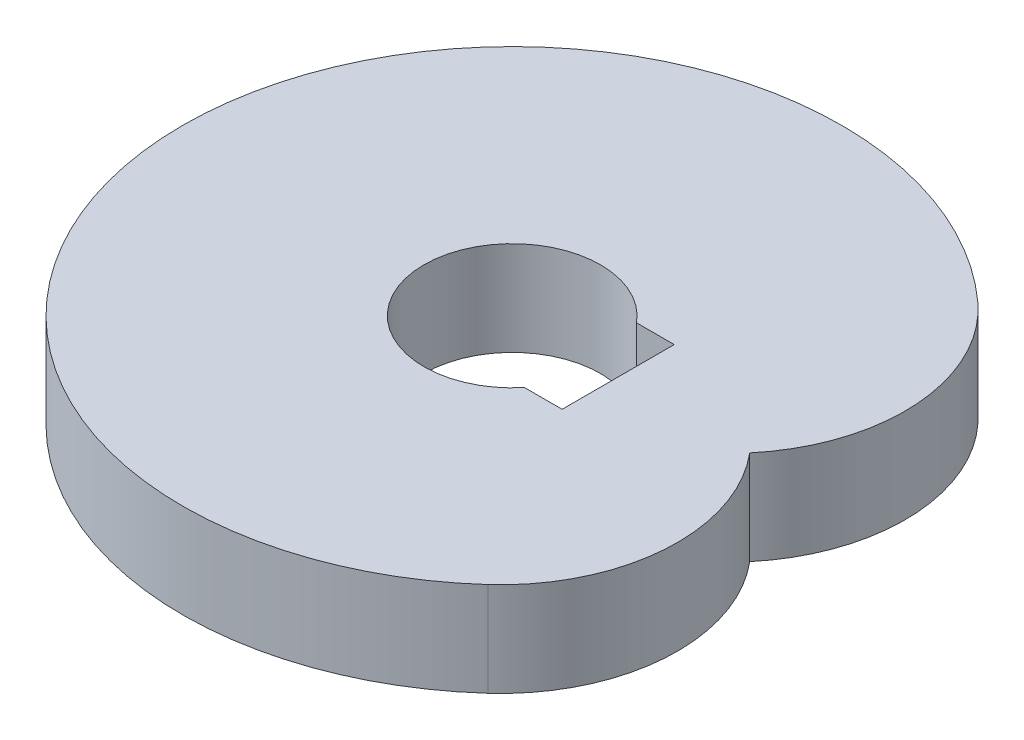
ISO-10303-21;
HEADER;
FILE_DESCRIPTION(('STEP AP214'),'2;1');
FILE_NAME('part.step','',(''),(''),'','','');
FILE_SCHEMA(('AUTOMOTIVE_DESIGN { 1 0 10303 214 1 1 1 1 }'));
ENDSEC;
DATA;
#1=APPLICATION_CONTEXT('core data for automotive mechanical design processes');
#2=APPLICATION_PROTOCOL_DEFINITION('international standard','automotive_design',2000,#1);
#3=PRODUCT_CONTEXT('',#1,'mechanical');
#4=PRODUCT('Part','Part','',(#3));
#5=PRODUCT_RELATED_PRODUCT_CATEGORY('part','',(#4));
#6=PRODUCT_DEFINITION_FORMATION('','',#4);
#7=PRODUCT_DEFINITION_CONTEXT('part definition',#1,'design');
#8=PRODUCT_DEFINITION('design','',#6,#7);
#9=PRODUCT_DEFINITION_SHAPE('','',#8);
#10=(LENGTH_UNIT() NAMED_UNIT(*) SI_UNIT(.MILLI.,.METRE.));
#11=(NAMED_UNIT(*) PLANE_ANGLE_UNIT() SI_UNIT($,.RADIAN.));
#12=(NAMED_UNIT(*) SI_UNIT($,.STERADIAN.) SOLID_ANGLE_UNIT());
#13=UNCERTAINTY_MEASURE_WITH_UNIT(LENGTH_MEASURE(1.E-05),#10,'distance_accuracy_value','');
#14=(GEOMETRIC_REPRESENTATION_CONTEXT(3) GLOBAL_UNCERTAINTY_ASSIGNED_CONTEXT((#13)) GLOBAL_UNIT_ASSIGNED_CONTEXT((#10,
#11,#12)) REPRESENTATION_CONTEXT('',''));
#15=CARTESIAN_POINT('',(0.,0.,0.));
#16=DIRECTION('',(0.,0.,1.));
#17=DIRECTION('',(1.,0.,0.));
#18=AXIS2_PLACEMENT_3D('',#15,#16,#17);
#19=CARTESIAN_POINT('',(-12.9999999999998,0.,119.));
#20=DIRECTION('',(0.,0.,1.));
#21=DIRECTION('',(1.,0.,0.));
#22=AXIS2_PLACEMENT_3D('',#19,#20,#21);
#23=PLANE('',#22);
#24=DIRECTION('',(0.,1.,0.));
#25=VECTOR('',#24,1.);
#26=CARTESIAN_POINT('',(144.897377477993,200.,119.));
#27=LINE('',#26,#25);
#28=CARTESIAN_POINT('',(144.897377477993,0.,119.));
#29=VERTEX_POINT('',#28);
#30=CARTESIAN_POINT('',(144.897377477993,200.,119.));
#31=VERTEX_POINT('',#30);
#32=EDGE_CURVE('E127',#29,#31,#27,.T.);
#33=ORIENTED_EDGE('',*,*,#32,.T.);
#34=DIRECTION('',(1.,0.,0.));
#35=VECTOR('',#34,1.);
#36=CARTESIAN_POINT('',(-12.9999999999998,200.,119.));
#37=LINE('',#36,#35);
#38=CARTESIAN_POINT('',(225.,200.,119.));
#39=VERTEX_POINT('',#38);
#40=EDGE_CURVE('E147',#31,#39,#37,.T.);
#41=ORIENTED_EDGE('',*,*,#40,.T.);
#42=DIRECTION('',(0.,1.,0.));
#43=VECTOR('',#42,1.);
#44=CARTESIAN_POINT('',(225.,0.,119.));
#45=LINE('',#44,#43);
#46=CARTESIAN_POINT('',(225.,0.,119.));
#47=VERTEX_POINT('',#46);
#48=EDGE_CURVE('E11',#47,#39,#45,.T.);
#49=ORIENTED_EDGE('',*,*,#48,.F.);
#50=DIRECTION('',(1.,0.,0.));
#51=VECTOR('',#50,1.);
#52=CARTESIAN_POINT('',(0.,0.,119.));
#53=LINE('',#52,#51);
#54=EDGE_CURVE('E150',#29,#47,#53,.T.);
#55=ORIENTED_EDGE('',*,*,#54,.F.);
#56=EDGE_LOOP('',(#33,#41,#49,#55));
#57=FACE_BOUND('',#56,.T.);
#58=ADVANCED_FACE('F16',(#57),#23,.F.);
#59=CARTESIAN_POINT('',(225.,0.,-119.));
#60=DIRECTION('',(1.,0.,0.));
#61=DIRECTION('',(0.,1.,0.));
#62=AXIS2_PLACEMENT_3D('',#59,#60,#61);
#63=PLANE('',#62);
#64=DIRECTION('',(0.,0.,-1.));
#65=VECTOR('',#64,1.);
#66=CARTESIAN_POINT('',(225.,200.,-119.));
#67=LINE('',#66,#65);
#68=CARTESIAN_POINT('',(225.,200.,-119.));
#69=VERTEX_POINT('',#68);
#70=EDGE_CURVE('E137',#39,#69,#67,.T.);
#71=ORIENTED_EDGE('',*,*,#70,.T.);
#72=DIRECTION('',(0.,1.,0.));
#73=VECTOR('',#72,1.);
#74=CARTESIAN_POINT('',(225.,0.,-119.));
#75=LINE('',#74,#73);
#76=CARTESIAN_POINT('',(225.,0.,-119.));
#77=VERTEX_POINT('',#76);
#78=EDGE_CURVE('E27',#77,#69,#75,.T.);
#79=ORIENTED_EDGE('',*,*,#78,.F.);
#80=DIRECTION('',(0.,0.,-1.));
#81=VECTOR('',#80,1.);
#82=CARTESIAN_POINT('',(225.,0.,-119.));
#83=LINE('',#82,#81);
#84=EDGE_CURVE('E142',#47,#77,#83,.T.);
#85=ORIENTED_EDGE('',*,*,#84,.F.);
#86=ORIENTED_EDGE('',*,*,#48,.T.);
#87=EDGE_LOOP('',(#71,#79,#85,#86));
#88=FACE_BOUND('',#87,.T.);
#89=ADVANCED_FACE('F164',(#88),#63,.F.);
#90=CARTESIAN_POINT('',(-12.9999999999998,0.,-119.));
#91=DIRECTION('',(0.,0.,-1.));
#92=DIRECTION('',(0.,-1.,0.));
#93=AXIS2_PLACEMENT_3D('',#90,#91,#92);
#94=PLANE('',#93);
#95=DIRECTION('',(0.,-1.,0.));
#96=VECTOR('',#95,1.);
#97=CARTESIAN_POINT('',(144.897377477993,200.,-119.));
#98=LINE('',#97,#96);
#99=CARTESIAN_POINT('',(144.897377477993,200.,-119.));
#100=VERTEX_POINT('',#99);
#101=CARTESIAN_POINT('',(144.897377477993,0.,-119.));
#102=VERTEX_POINT('',#101);
#103=EDGE_CURVE('E141',#100,#102,#98,.T.);
#104=ORIENTED_EDGE('',*,*,#103,.T.);
#105=DIRECTION('',(-1.,0.,0.));
#106=VECTOR('',#105,1.);
#107=CARTESIAN_POINT('',(-12.9999999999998,0.,-119.));
#108=LINE('',#107,#106);
#109=EDGE_CURVE('E146',#77,#102,#108,.T.);
#110=ORIENTED_EDGE('',*,*,#109,.F.);
#111=ORIENTED_EDGE('',*,*,#78,.T.);
#112=DIRECTION('',(-1.,0.,0.));
#113=VECTOR('',#112,1.);
#114=CARTESIAN_POINT('',(-12.9999999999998,200.,-119.));
#115=LINE('',#114,#113);
#116=EDGE_CURVE('E133',#69,#100,#115,.T.);
#117=ORIENTED_EDGE('',*,*,#116,.T.);
#118=EDGE_LOOP('',(#104,#110,#111,#117));
#119=FACE_BOUND('',#118,.T.);
#120=ADVANCED_FACE('F173',(#119),#94,.F.);
#121=CARTESIAN_POINT('',(0.,0.,0.));
#122=DIRECTION('',(0.,1.,0.));
#123=DIRECTION('',(1.,0.,0.));
#124=AXIS2_PLACEMENT_3D('',#121,#122,#123);
#125=PLANE('',#124);
#126=ORIENTED_EDGE('',*,*,#84,.T.);
#127=ORIENTED_EDGE('',*,*,#109,.T.);
#128=CARTESIAN_POINT('',(0.,0.,0.));
#129=DIRECTION('',(0.,1.,0.));
#130=DIRECTION('',(0.,0.,1.));
#131=AXIS2_PLACEMENT_3D('',#128,#129,#130);
#132=CIRCLE('',#131,187.5);
#133=EDGE_CURVE('E130',#102,#29,#132,.T.);
#134=ORIENTED_EDGE('',*,*,#133,.T.);
#135=ORIENTED_EDGE('',*,*,#54,.T.);
#136=EDGE_LOOP('',(#126,#127,#134,#135));
#137=FACE_BOUND('',#136,.T.);
#138=CARTESIAN_POINT('',(217.46744706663,0.,241.522068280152));
#139=DIRECTION('',(0.,1.,0.));
#140=DIRECTION('',(0.,0.,1.));
#141=AXIS2_PLACEMENT_3D('',#138,#139,#140);
#142=CIRCLE('',#141,375.);
#143=CARTESIAN_POINT('',(468.391424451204,0.,520.201377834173));
#144=VERTEX_POINT('',#143);
#145=CARTESIAN_POINT('',(504.333427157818,0.,-1.38777878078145E-13));
#146=VERTEX_POINT('',#145);
#147=EDGE_CURVE('E96',#144,#146,#142,.T.);
#148=ORIENTED_EDGE('',*,*,#147,.F.);
#149=CARTESIAN_POINT('',(0.,0.,0.));
#150=DIRECTION('',(0.,1.,0.));
#151=DIRECTION('',(0.,0.,1.));
#152=AXIS2_PLACEMENT_3D('',#149,#150,#151);
#153=CIRCLE('',#152,700.);
#154=CARTESIAN_POINT('',(468.391424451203,0.,-520.201377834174));
#155=VERTEX_POINT('',#154);
#156=EDGE_CURVE('E97',#155,#144,#153,.T.);
#157=ORIENTED_EDGE('',*,*,#156,.F.);
#158=CARTESIAN_POINT('',(217.46744706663,0.,-241.522068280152));
#159=DIRECTION('',(0.,1.,0.));
#160=DIRECTION('',(0.,0.,1.));
#161=AXIS2_PLACEMENT_3D('',#158,#159,#160);
#162=CIRCLE('',#161,375.);
#163=EDGE_CURVE('E93',#146,#155,#162,.T.);
#164=ORIENTED_EDGE('',*,*,#163,.F.);
#165=EDGE_LOOP('',(#148,#157,#164));
#166=FACE_BOUND('',#165,.T.);
#167=ADVANCED_FACE('F18',(#137,#166),#125,.F.);
#168=CARTESIAN_POINT('',(0.,200.,0.));
#169=DIRECTION('',(0.,1.,0.));
#170=DIRECTION('',(1.,0.,0.));
#171=AXIS2_PLACEMENT_3D('',#168,#169,#170);
#172=PLANE('',#171);
#173=ORIENTED_EDGE('',*,*,#116,.F.);
#174=ORIENTED_EDGE('',*,*,#70,.F.);
#175=ORIENTED_EDGE('',*,*,#40,.F.);
#176=CARTESIAN_POINT('',(0.,200.,0.));
#177=DIRECTION('',(0.,1.,0.));
#178=DIRECTION('',(0.,0.,1.));
#179=AXIS2_PLACEMENT_3D('',#176,#177,#178);
#180=CIRCLE('',#179,187.5);
#181=EDGE_CURVE('E125',#100,#31,#180,.T.);
#182=ORIENTED_EDGE('',*,*,#181,.F.);
#183=EDGE_LOOP('',(#173,#174,#175,#182));
#184=FACE_BOUND('',#183,.T.);
#185=CARTESIAN_POINT('',(217.46744706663,200.,241.522068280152));
#186=DIRECTION('',(0.,1.,0.));
#187=DIRECTION('',(0.,0.,1.));
#188=AXIS2_PLACEMENT_3D('',#185,#186,#187);
#189=CIRCLE('',#188,375.);
#190=CARTESIAN_POINT('',(468.391424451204,200.,520.201377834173));
#191=VERTEX_POINT('',#190);
#192=CARTESIAN_POINT('',(504.333427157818,200.,-1.38777878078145E-13));
#193=VERTEX_POINT('',#192);
#194=EDGE_CURVE('E113',#191,#193,#189,.T.);
#195=ORIENTED_EDGE('',*,*,#194,.T.);
#196=CARTESIAN_POINT('',(217.46744706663,200.,-241.522068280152));
#197=DIRECTION('',(0.,1.,0.));
#198=DIRECTION('',(0.,0.,1.));
#199=AXIS2_PLACEMENT_3D('',#196,#197,#198);
#200=CIRCLE('',#199,375.);
#201=CARTESIAN_POINT('',(468.391424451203,200.,-520.201377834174));
#202=VERTEX_POINT('',#201);
#203=EDGE_CURVE('E20',#193,#202,#200,.T.);
#204=ORIENTED_EDGE('',*,*,#203,.T.);
#205=CARTESIAN_POINT('',(0.,200.,0.));
#206=DIRECTION('',(0.,1.,0.));
#207=DIRECTION('',(0.,0.,1.));
#208=AXIS2_PLACEMENT_3D('',#205,#206,#207);
#209=CIRCLE('',#208,700.);
#210=EDGE_CURVE('E138',#202,#191,#209,.T.);
#211=ORIENTED_EDGE('',*,*,#210,.T.);
#212=EDGE_LOOP('',(#195,#204,#211));
#213=FACE_BOUND('',#212,.T.);
#214=ADVANCED_FACE('F167',(#184,#213),#172,.T.);
#215=CARTESIAN_POINT('',(0.,200.,0.));
#216=DIRECTION('',(0.,-1.,0.));
#217=DIRECTION('',(0.,0.,-1.));
#218=AXIS2_PLACEMENT_3D('',#215,#216,#217);
#219=CYLINDRICAL_SURFACE('',#218,187.5);
#220=ORIENTED_EDGE('',*,*,#103,.F.);
#221=ORIENTED_EDGE('',*,*,#181,.T.);
#222=ORIENTED_EDGE('',*,*,#32,.F.);
#223=ORIENTED_EDGE('',*,*,#133,.F.);
#224=EDGE_LOOP('',(#220,#221,#222,#223));
#225=FACE_BOUND('',#224,.T.);
#226=ADVANCED_FACE('F258',(#225),#219,.F.);
#227=CARTESIAN_POINT('',(0.,200.,0.));
#228=DIRECTION('',(0.,-1.,0.));
#229=DIRECTION('',(0.,0.,-1.));
#230=AXIS2_PLACEMENT_3D('',#227,#228,#229);
#231=CYLINDRICAL_SURFACE('',#230,700.);
#232=ORIENTED_EDGE('',*,*,#156,.T.);
#233=DIRECTION('',(0.,-1.,0.));
#234=VECTOR('',#233,1.);
#235=CARTESIAN_POINT('',(468.391424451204,200.,520.201377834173));
#236=LINE('',#235,#234);
#237=EDGE_CURVE('E103',#191,#144,#236,.T.);
#238=ORIENTED_EDGE('',*,*,#237,.F.);
#239=ORIENTED_EDGE('',*,*,#210,.F.);
#240=DIRECTION('',(0.,-1.,0.));
#241=VECTOR('',#240,1.);
#242=CARTESIAN_POINT('',(468.391424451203,200.,-520.201377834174));
#243=LINE('',#242,#241);
#244=EDGE_CURVE('E102',#202,#155,#243,.T.);
#245=ORIENTED_EDGE('',*,*,#244,.T.);
#246=EDGE_LOOP('',(#232,#238,#239,#245));
#247=FACE_BOUND('',#246,.T.);
#248=ADVANCED_FACE('F262',(#247),#231,.T.);
#249=CARTESIAN_POINT('',(217.46744706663,200.,-241.522068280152));
#250=DIRECTION('',(0.,-1.,0.));
#251=DIRECTION('',(0.,0.,-1.));
#252=AXIS2_PLACEMENT_3D('',#249,#250,#251);
#253=CYLINDRICAL_SURFACE('',#252,375.);
#254=ORIENTED_EDGE('',*,*,#163,.T.);
#255=ORIENTED_EDGE('',*,*,#244,.F.);
#256=ORIENTED_EDGE('',*,*,#203,.F.);
#257=DIRECTION('',(0.,-1.,0.));
#258=VECTOR('',#257,1.);
#259=CARTESIAN_POINT('',(504.333427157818,200.,-1.38777878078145E-13));
#260=LINE('',#259,#258);
#261=EDGE_CURVE('E106',#193,#146,#260,.T.);
#262=ORIENTED_EDGE('',*,*,#261,.T.);
#263=EDGE_LOOP('',(#254,#255,#256,#262));
#264=FACE_BOUND('',#263,.T.);
#265=ADVANCED_FACE('F107',(#264),#253,.T.);
#266=CARTESIAN_POINT('',(217.46744706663,200.,241.522068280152));
#267=DIRECTION('',(0.,-1.,0.));
#268=DIRECTION('',(0.,0.,-1.));
#269=AXIS2_PLACEMENT_3D('',#266,#267,#268);
#270=CYLINDRICAL_SURFACE('',#269,375.);
#271=ORIENTED_EDGE('',*,*,#147,.T.);
#272=ORIENTED_EDGE('',*,*,#261,.F.);
#273=ORIENTED_EDGE('',*,*,#194,.F.);
#274=ORIENTED_EDGE('',*,*,#237,.T.);
#275=EDGE_LOOP('',(#271,#272,#273,#274));
#276=FACE_BOUND('',#275,.T.);
#277=ADVANCED_FACE('F115',(#276),#270,.T.);
#278=CLOSED_SHELL('',(#58,#89,#120,#167,#214,#226,#248,#265,#277));
#279=MANIFOLD_SOLID_BREP('B1',#278);
#280=ADVANCED_BREP_SHAPE_REPRESENTATION('',(#18,#279),#14);
#281=SHAPE_DEFINITION_REPRESENTATION(#9,#280);
ENDSEC;
END-ISO-10303-21;
